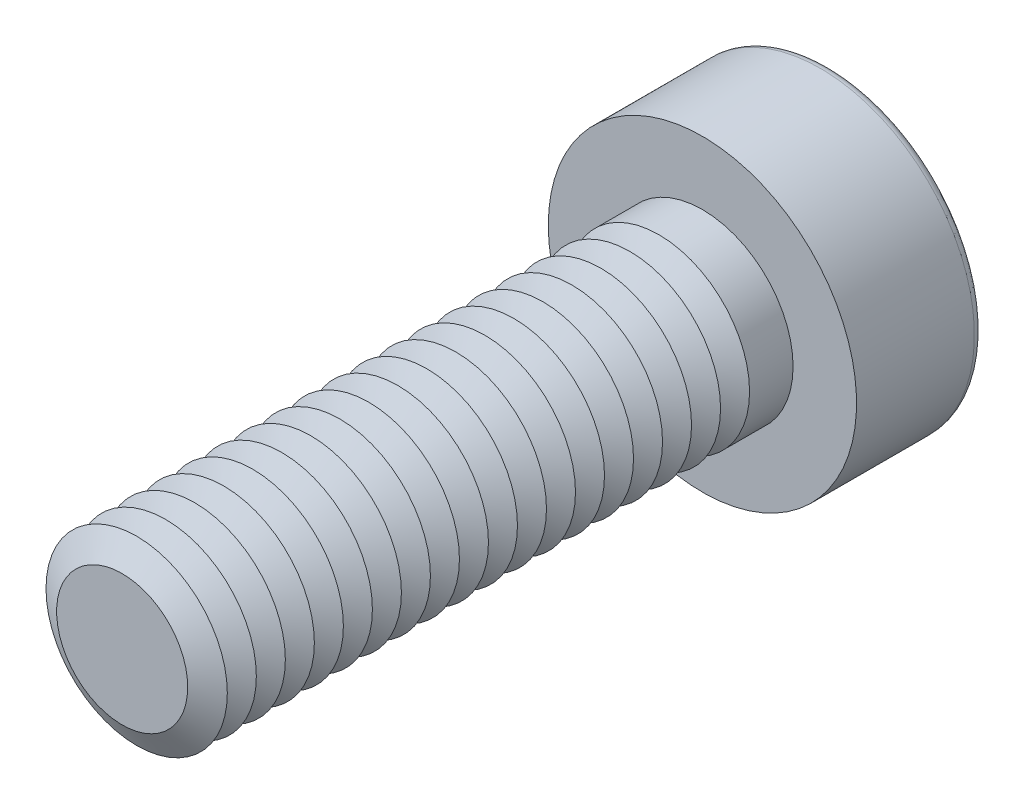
ISO-10303-21;
HEADER;
FILE_DESCRIPTION(('STEP AP214'),'2;1');
FILE_NAME('part.step','',(''),(''),'','','');
FILE_SCHEMA(('AUTOMOTIVE_DESIGN { 1 0 10303 214 1 1 1 1 }'));
ENDSEC;
DATA;
#1=APPLICATION_CONTEXT('core data for automotive mechanical design processes');
#2=APPLICATION_PROTOCOL_DEFINITION('international standard','automotive_design',2000,#1);
#3=PRODUCT_CONTEXT('',#1,'mechanical');
#4=PRODUCT('Part','Part','',(#3));
#5=PRODUCT_RELATED_PRODUCT_CATEGORY('part','',(#4));
#6=PRODUCT_DEFINITION_FORMATION('','',#4);
#7=PRODUCT_DEFINITION_CONTEXT('part definition',#1,'design');
#8=PRODUCT_DEFINITION('design','',#6,#7);
#9=PRODUCT_DEFINITION_SHAPE('','',#8);
#10=(LENGTH_UNIT() NAMED_UNIT(*) SI_UNIT(.MILLI.,.METRE.));
#11=(NAMED_UNIT(*) PLANE_ANGLE_UNIT() SI_UNIT($,.RADIAN.));
#12=(NAMED_UNIT(*) SI_UNIT($,.STERADIAN.) SOLID_ANGLE_UNIT());
#13=UNCERTAINTY_MEASURE_WITH_UNIT(LENGTH_MEASURE(1.E-05),#10,'distance_accuracy_value','');
#14=(GEOMETRIC_REPRESENTATION_CONTEXT(3) GLOBAL_UNCERTAINTY_ASSIGNED_CONTEXT((#13)) GLOBAL_UNIT_ASSIGNED_CONTEXT((#10,
#11,#12)) REPRESENTATION_CONTEXT('',''));
#15=CARTESIAN_POINT('',(0.,0.,0.));
#16=DIRECTION('',(0.,0.,1.));
#17=DIRECTION('',(1.,0.,0.));
#18=AXIS2_PLACEMENT_3D('',#15,#16,#17);
#19=CARTESIAN_POINT('',(0.,0.,13.2));
#20=DIRECTION('',(0.,0.,1.));
#21=DIRECTION('',(1.,0.,0.));
#22=AXIS2_PLACEMENT_3D('',#19,#20,#21);
#23=CONICAL_SURFACE('',#22,2.5,1.0471975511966);
#24=CARTESIAN_POINT('',(0.,0.,12.8));
#25=DIRECTION('',(0.,0.,1.));
#26=DIRECTION('',(1.,0.,0.));
#27=AXIS2_PLACEMENT_3D('',#24,#25,#26);
#28=CIRCLE('',#27,1.80717967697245);
#29=CARTESIAN_POINT('',(1.80717967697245,0.,12.8));
#30=VERTEX_POINT('',#29);
#31=EDGE_CURVE('E313',#30,#30,#28,.T.);
#32=ORIENTED_EDGE('',*,*,#31,.T.);
#33=EDGE_LOOP('',(#32));
#34=FACE_BOUND('',#33,.T.);
#35=CARTESIAN_POINT('',(0.,0.,13.2));
#36=DIRECTION('',(0.,0.,1.));
#37=DIRECTION('',(1.,0.,0.));
#38=AXIS2_PLACEMENT_3D('',#35,#36,#37);
#39=CIRCLE('',#38,2.5);
#40=CARTESIAN_POINT('',(2.5,0.,13.2));
#41=VERTEX_POINT('',#40);
#42=EDGE_CURVE('E316',#41,#41,#39,.T.);
#43=ORIENTED_EDGE('',*,*,#42,.F.);
#44=EDGE_LOOP('',(#43));
#45=FACE_BOUND('',#44,.T.);
#46=ADVANCED_FACE('F39',(#34,#45),#23,.T.);
#47=CARTESIAN_POINT('',(0.,0.,12.8));
#48=DIRECTION('',(0.,0.,-1.));
#49=DIRECTION('',(-1.,0.,0.));
#50=AXIS2_PLACEMENT_3D('',#47,#48,#49);
#51=CONICAL_SURFACE('',#50,1.80717967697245,1.0471975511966);
#52=CARTESIAN_POINT('',(0.,0.,12.4));
#53=DIRECTION('',(0.,0.,1.));
#54=DIRECTION('',(1.,0.,0.));
#55=AXIS2_PLACEMENT_3D('',#52,#53,#54);
#56=CIRCLE('',#55,2.5);
#57=CARTESIAN_POINT('',(2.5,0.,12.4));
#58=VERTEX_POINT('',#57);
#59=EDGE_CURVE('E324',#58,#58,#56,.T.);
#60=ORIENTED_EDGE('',*,*,#59,.T.);
#61=EDGE_LOOP('',(#60));
#62=FACE_BOUND('',#61,.T.);
#63=ORIENTED_EDGE('',*,*,#31,.F.);
#64=EDGE_LOOP('',(#63));
#65=FACE_BOUND('',#64,.T.);
#66=ADVANCED_FACE('F245',(#62,#65),#51,.T.);
#67=CARTESIAN_POINT('',(0.,0.,16.));
#68=DIRECTION('',(0.,0.,1.));
#69=DIRECTION('',(1.,0.,0.));
#70=AXIS2_PLACEMENT_3D('',#67,#68,#69);
#71=PLANE('',#70);
#72=CARTESIAN_POINT('',(0.,0.,16.));
#73=DIRECTION('',(0.,0.,1.));
#74=DIRECTION('',(1.,0.,0.));
#75=AXIS2_PLACEMENT_3D('',#72,#73,#74);
#76=CIRCLE('',#75,1.80717967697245);
#77=CARTESIAN_POINT('',(1.80717967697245,0.,16.));
#78=VERTEX_POINT('',#77);
#79=EDGE_CURVE('E174',#78,#78,#76,.T.);
#80=ORIENTED_EDGE('',*,*,#79,.T.);
#81=EDGE_LOOP('',(#80));
#82=FACE_BOUND('',#81,.T.);
#83=ADVANCED_FACE('F251',(#82),#71,.T.);
#84=CARTESIAN_POINT('',(0.,0.,16.));
#85=DIRECTION('',(0.,0.,-1.));
#86=DIRECTION('',(-1.,0.,0.));
#87=AXIS2_PLACEMENT_3D('',#84,#85,#86);
#88=CONICAL_SURFACE('',#87,1.80717967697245,1.0471975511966);
#89=CARTESIAN_POINT('',(0.,0.,15.6));
#90=DIRECTION('',(0.,0.,1.));
#91=DIRECTION('',(1.,0.,0.));
#92=AXIS2_PLACEMENT_3D('',#89,#90,#91);
#93=CIRCLE('',#92,2.5);
#94=CARTESIAN_POINT('',(2.5,0.,15.6));
#95=VERTEX_POINT('',#94);
#96=EDGE_CURVE('E291',#95,#95,#93,.T.);
#97=ORIENTED_EDGE('',*,*,#96,.T.);
#98=EDGE_LOOP('',(#97));
#99=FACE_BOUND('',#98,.T.);
#100=ORIENTED_EDGE('',*,*,#79,.F.);
#101=EDGE_LOOP('',(#100));
#102=FACE_BOUND('',#101,.T.);
#103=ADVANCED_FACE('F199',(#99,#102),#88,.T.);
#104=CARTESIAN_POINT('',(0.,0.,15.6));
#105=DIRECTION('',(0.,0.,1.));
#106=DIRECTION('',(1.,0.,0.));
#107=AXIS2_PLACEMENT_3D('',#104,#105,#106);
#108=CONICAL_SURFACE('',#107,2.5,1.0471975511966);
#109=CARTESIAN_POINT('',(0.,0.,15.2));
#110=DIRECTION('',(0.,0.,1.));
#111=DIRECTION('',(1.,0.,0.));
#112=AXIS2_PLACEMENT_3D('',#109,#110,#111);
#113=CIRCLE('',#112,1.80717967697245);
#114=CARTESIAN_POINT('',(1.80717967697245,0.,15.2));
#115=VERTEX_POINT('',#114);
#116=EDGE_CURVE('E288',#115,#115,#113,.T.);
#117=ORIENTED_EDGE('',*,*,#116,.T.);
#118=EDGE_LOOP('',(#117));
#119=FACE_BOUND('',#118,.T.);
#120=ORIENTED_EDGE('',*,*,#96,.F.);
#121=EDGE_LOOP('',(#120));
#122=FACE_BOUND('',#121,.T.);
#123=ADVANCED_FACE('F277',(#119,#122),#108,.T.);
#124=CARTESIAN_POINT('',(0.,0.,15.2));
#125=DIRECTION('',(0.,0.,-1.));
#126=DIRECTION('',(-1.,0.,0.));
#127=AXIS2_PLACEMENT_3D('',#124,#125,#126);
#128=CONICAL_SURFACE('',#127,1.80717967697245,1.0471975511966);
#129=CARTESIAN_POINT('',(0.,0.,14.8));
#130=DIRECTION('',(0.,0.,1.));
#131=DIRECTION('',(1.,0.,0.));
#132=AXIS2_PLACEMENT_3D('',#129,#130,#131);
#133=CIRCLE('',#132,2.5);
#134=CARTESIAN_POINT('',(2.5,0.,14.8));
#135=VERTEX_POINT('',#134);
#136=EDGE_CURVE('E299',#135,#135,#133,.T.);
#137=ORIENTED_EDGE('',*,*,#136,.T.);
#138=EDGE_LOOP('',(#137));
#139=FACE_BOUND('',#138,.T.);
#140=ORIENTED_EDGE('',*,*,#116,.F.);
#141=EDGE_LOOP('',(#140));
#142=FACE_BOUND('',#141,.T.);
#143=ADVANCED_FACE('F274',(#139,#142),#128,.T.);
#144=CARTESIAN_POINT('',(0.,0.,14.8));
#145=DIRECTION('',(0.,0.,1.));
#146=DIRECTION('',(1.,0.,0.));
#147=AXIS2_PLACEMENT_3D('',#144,#145,#146);
#148=CONICAL_SURFACE('',#147,2.5,1.0471975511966);
#149=CARTESIAN_POINT('',(0.,0.,14.4));
#150=DIRECTION('',(0.,0.,1.));
#151=DIRECTION('',(1.,0.,0.));
#152=AXIS2_PLACEMENT_3D('',#149,#150,#151);
#153=CIRCLE('',#152,1.80717967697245);
#154=CARTESIAN_POINT('',(1.80717967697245,0.,14.4));
#155=VERTEX_POINT('',#154);
#156=EDGE_CURVE('E293',#155,#155,#153,.T.);
#157=ORIENTED_EDGE('',*,*,#156,.T.);
#158=EDGE_LOOP('',(#157));
#159=FACE_BOUND('',#158,.T.);
#160=ORIENTED_EDGE('',*,*,#136,.F.);
#161=EDGE_LOOP('',(#160));
#162=FACE_BOUND('',#161,.T.);
#163=ADVANCED_FACE('F270',(#159,#162),#148,.T.);
#164=CARTESIAN_POINT('',(0.,0.,14.4));
#165=DIRECTION('',(0.,0.,-1.));
#166=DIRECTION('',(-1.,0.,0.));
#167=AXIS2_PLACEMENT_3D('',#164,#165,#166);
#168=CONICAL_SURFACE('',#167,1.80717967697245,1.0471975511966);
#169=CARTESIAN_POINT('',(0.,0.,14.));
#170=DIRECTION('',(0.,0.,1.));
#171=DIRECTION('',(1.,0.,0.));
#172=AXIS2_PLACEMENT_3D('',#169,#170,#171);
#173=CIRCLE('',#172,2.5);
#174=CARTESIAN_POINT('',(2.5,0.,14.));
#175=VERTEX_POINT('',#174);
#176=EDGE_CURVE('E309',#175,#175,#173,.T.);
#177=ORIENTED_EDGE('',*,*,#176,.T.);
#178=EDGE_LOOP('',(#177));
#179=FACE_BOUND('',#178,.T.);
#180=ORIENTED_EDGE('',*,*,#156,.F.);
#181=EDGE_LOOP('',(#180));
#182=FACE_BOUND('',#181,.T.);
#183=ADVANCED_FACE('F266',(#179,#182),#168,.T.);
#184=CARTESIAN_POINT('',(0.,0.,14.));
#185=DIRECTION('',(0.,0.,1.));
#186=DIRECTION('',(1.,0.,0.));
#187=AXIS2_PLACEMENT_3D('',#184,#185,#186);
#188=CONICAL_SURFACE('',#187,2.5,1.0471975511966);
#189=CARTESIAN_POINT('',(0.,0.,13.6));
#190=DIRECTION('',(0.,0.,1.));
#191=DIRECTION('',(1.,0.,0.));
#192=AXIS2_PLACEMENT_3D('',#189,#190,#191);
#193=CIRCLE('',#192,1.80717967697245);
#194=CARTESIAN_POINT('',(1.80717967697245,0.,13.6));
#195=VERTEX_POINT('',#194);
#196=EDGE_CURVE('E305',#195,#195,#193,.T.);
#197=ORIENTED_EDGE('',*,*,#196,.T.);
#198=EDGE_LOOP('',(#197));
#199=FACE_BOUND('',#198,.T.);
#200=ORIENTED_EDGE('',*,*,#176,.F.);
#201=EDGE_LOOP('',(#200));
#202=FACE_BOUND('',#201,.T.);
#203=ADVANCED_FACE('F262',(#199,#202),#188,.T.);
#204=CARTESIAN_POINT('',(0.,0.,13.6));
#205=DIRECTION('',(0.,0.,-1.));
#206=DIRECTION('',(-1.,0.,0.));
#207=AXIS2_PLACEMENT_3D('',#204,#205,#206);
#208=CONICAL_SURFACE('',#207,1.80717967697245,1.0471975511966);
#209=ORIENTED_EDGE('',*,*,#42,.T.);
#210=EDGE_LOOP('',(#209));
#211=FACE_BOUND('',#210,.T.);
#212=ORIENTED_EDGE('',*,*,#196,.F.);
#213=EDGE_LOOP('',(#212));
#214=FACE_BOUND('',#213,.T.);
#215=ADVANCED_FACE('F258',(#211,#214),#208,.T.);
#216=CARTESIAN_POINT('',(0.,0.,12.4));
#217=DIRECTION('',(0.,0.,1.));
#218=DIRECTION('',(1.,0.,0.));
#219=AXIS2_PLACEMENT_3D('',#216,#217,#218);
#220=CONICAL_SURFACE('',#219,2.5,1.0471975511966);
#221=CARTESIAN_POINT('',(0.,0.,12.));
#222=DIRECTION('',(0.,0.,1.));
#223=DIRECTION('',(1.,0.,0.));
#224=AXIS2_PLACEMENT_3D('',#221,#222,#223);
#225=CIRCLE('',#224,1.80717967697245);
#226=CARTESIAN_POINT('',(1.80717967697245,0.,12.));
#227=VERTEX_POINT('',#226);
#228=EDGE_CURVE('E320',#227,#227,#225,.T.);
#229=ORIENTED_EDGE('',*,*,#228,.T.);
#230=EDGE_LOOP('',(#229));
#231=FACE_BOUND('',#230,.T.);
#232=ORIENTED_EDGE('',*,*,#59,.F.);
#233=EDGE_LOOP('',(#232));
#234=FACE_BOUND('',#233,.T.);
#235=ADVANCED_FACE('F261',(#231,#234),#220,.T.);
#236=CARTESIAN_POINT('',(0.,0.,12.));
#237=DIRECTION('',(0.,0.,-1.));
#238=DIRECTION('',(-1.,0.,0.));
#239=AXIS2_PLACEMENT_3D('',#236,#237,#238);
#240=CONICAL_SURFACE('',#239,1.80717967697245,1.0471975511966);
#241=CARTESIAN_POINT('',(0.,0.,11.6));
#242=DIRECTION('',(0.,0.,1.));
#243=DIRECTION('',(1.,0.,0.));
#244=AXIS2_PLACEMENT_3D('',#241,#242,#243);
#245=CIRCLE('',#244,2.5);
#246=CARTESIAN_POINT('',(2.5,0.,11.6));
#247=VERTEX_POINT('',#246);
#248=EDGE_CURVE('E331',#247,#247,#245,.T.);
#249=ORIENTED_EDGE('',*,*,#248,.T.);
#250=EDGE_LOOP('',(#249));
#251=FACE_BOUND('',#250,.T.);
#252=ORIENTED_EDGE('',*,*,#228,.F.);
#253=EDGE_LOOP('',(#252));
#254=FACE_BOUND('',#253,.T.);
#255=ADVANCED_FACE('F543',(#251,#254),#240,.T.);
#256=CARTESIAN_POINT('',(0.,0.,11.6));
#257=DIRECTION('',(0.,0.,1.));
#258=DIRECTION('',(1.,0.,0.));
#259=AXIS2_PLACEMENT_3D('',#256,#257,#258);
#260=CONICAL_SURFACE('',#259,2.5,1.0471975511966);
#261=CARTESIAN_POINT('',(0.,0.,11.2));
#262=DIRECTION('',(0.,0.,1.));
#263=DIRECTION('',(1.,0.,0.));
#264=AXIS2_PLACEMENT_3D('',#261,#262,#263);
#265=CIRCLE('',#264,1.80717967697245);
#266=CARTESIAN_POINT('',(1.80717967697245,0.,11.2));
#267=VERTEX_POINT('',#266);
#268=EDGE_CURVE('E328',#267,#267,#265,.T.);
#269=ORIENTED_EDGE('',*,*,#268,.T.);
#270=EDGE_LOOP('',(#269));
#271=FACE_BOUND('',#270,.T.);
#272=ORIENTED_EDGE('',*,*,#248,.F.);
#273=EDGE_LOOP('',(#272));
#274=FACE_BOUND('',#273,.T.);
#275=ADVANCED_FACE('F539',(#271,#274),#260,.T.);
#276=CARTESIAN_POINT('',(0.,0.,11.2));
#277=DIRECTION('',(0.,0.,-1.));
#278=DIRECTION('',(-1.,0.,0.));
#279=AXIS2_PLACEMENT_3D('',#276,#277,#278);
#280=CONICAL_SURFACE('',#279,1.80717967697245,1.0471975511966);
#281=CARTESIAN_POINT('',(0.,0.,10.8));
#282=DIRECTION('',(0.,0.,1.));
#283=DIRECTION('',(1.,0.,0.));
#284=AXIS2_PLACEMENT_3D('',#281,#282,#283);
#285=CIRCLE('',#284,2.5);
#286=CARTESIAN_POINT('',(2.5,0.,10.8));
#287=VERTEX_POINT('',#286);
#288=EDGE_CURVE('E339',#287,#287,#285,.T.);
#289=ORIENTED_EDGE('',*,*,#288,.T.);
#290=EDGE_LOOP('',(#289));
#291=FACE_BOUND('',#290,.T.);
#292=ORIENTED_EDGE('',*,*,#268,.F.);
#293=EDGE_LOOP('',(#292));
#294=FACE_BOUND('',#293,.T.);
#295=ADVANCED_FACE('F535',(#291,#294),#280,.T.);
#296=CARTESIAN_POINT('',(0.,0.,10.8));
#297=DIRECTION('',(0.,0.,1.));
#298=DIRECTION('',(1.,0.,0.));
#299=AXIS2_PLACEMENT_3D('',#296,#297,#298);
#300=CONICAL_SURFACE('',#299,2.5,1.0471975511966);
#301=CARTESIAN_POINT('',(0.,0.,10.4));
#302=DIRECTION('',(0.,0.,1.));
#303=DIRECTION('',(1.,0.,0.));
#304=AXIS2_PLACEMENT_3D('',#301,#302,#303);
#305=CIRCLE('',#304,1.80717967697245);
#306=CARTESIAN_POINT('',(1.80717967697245,0.,10.4));
#307=VERTEX_POINT('',#306);
#308=EDGE_CURVE('E335',#307,#307,#305,.T.);
#309=ORIENTED_EDGE('',*,*,#308,.T.);
#310=EDGE_LOOP('',(#309));
#311=FACE_BOUND('',#310,.T.);
#312=ORIENTED_EDGE('',*,*,#288,.F.);
#313=EDGE_LOOP('',(#312));
#314=FACE_BOUND('',#313,.T.);
#315=ADVANCED_FACE('F531',(#311,#314),#300,.T.);
#316=CARTESIAN_POINT('',(0.,0.,10.4));
#317=DIRECTION('',(0.,0.,-1.));
#318=DIRECTION('',(-1.,0.,0.));
#319=AXIS2_PLACEMENT_3D('',#316,#317,#318);
#320=CONICAL_SURFACE('',#319,1.80717967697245,1.0471975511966);
#321=CARTESIAN_POINT('',(0.,0.,10.));
#322=DIRECTION('',(0.,0.,1.));
#323=DIRECTION('',(1.,0.,0.));
#324=AXIS2_PLACEMENT_3D('',#321,#322,#323);
#325=CIRCLE('',#324,2.5);
#326=CARTESIAN_POINT('',(2.5,0.,10.));
#327=VERTEX_POINT('',#326);
#328=EDGE_CURVE('E347',#327,#327,#325,.T.);
#329=ORIENTED_EDGE('',*,*,#328,.T.);
#330=EDGE_LOOP('',(#329));
#331=FACE_BOUND('',#330,.T.);
#332=ORIENTED_EDGE('',*,*,#308,.F.);
#333=EDGE_LOOP('',(#332));
#334=FACE_BOUND('',#333,.T.);
#335=ADVANCED_FACE('F527',(#331,#334),#320,.T.);
#336=CARTESIAN_POINT('',(0.,0.,10.));
#337=DIRECTION('',(0.,0.,1.));
#338=DIRECTION('',(1.,0.,0.));
#339=AXIS2_PLACEMENT_3D('',#336,#337,#338);
#340=CONICAL_SURFACE('',#339,2.5,1.0471975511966);
#341=CARTESIAN_POINT('',(0.,0.,9.6));
#342=DIRECTION('',(0.,0.,1.));
#343=DIRECTION('',(1.,0.,0.));
#344=AXIS2_PLACEMENT_3D('',#341,#342,#343);
#345=CIRCLE('',#344,1.80717967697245);
#346=CARTESIAN_POINT('',(1.80717967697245,0.,9.6));
#347=VERTEX_POINT('',#346);
#348=EDGE_CURVE('E343',#347,#347,#345,.T.);
#349=ORIENTED_EDGE('',*,*,#348,.T.);
#350=EDGE_LOOP('',(#349));
#351=FACE_BOUND('',#350,.T.);
#352=ORIENTED_EDGE('',*,*,#328,.F.);
#353=EDGE_LOOP('',(#352));
#354=FACE_BOUND('',#353,.T.);
#355=ADVANCED_FACE('F523',(#351,#354),#340,.T.);
#356=CARTESIAN_POINT('',(0.,0.,9.6));
#357=DIRECTION('',(0.,0.,-1.));
#358=DIRECTION('',(-1.,0.,0.));
#359=AXIS2_PLACEMENT_3D('',#356,#357,#358);
#360=CONICAL_SURFACE('',#359,1.80717967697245,1.0471975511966);
#361=CARTESIAN_POINT('',(0.,0.,9.2));
#362=DIRECTION('',(0.,0.,1.));
#363=DIRECTION('',(1.,0.,0.));
#364=AXIS2_PLACEMENT_3D('',#361,#362,#363);
#365=CIRCLE('',#364,2.5);
#366=CARTESIAN_POINT('',(2.5,0.,9.2));
#367=VERTEX_POINT('',#366);
#368=EDGE_CURVE('E355',#367,#367,#365,.T.);
#369=ORIENTED_EDGE('',*,*,#368,.T.);
#370=EDGE_LOOP('',(#369));
#371=FACE_BOUND('',#370,.T.);
#372=ORIENTED_EDGE('',*,*,#348,.F.);
#373=EDGE_LOOP('',(#372));
#374=FACE_BOUND('',#373,.T.);
#375=ADVANCED_FACE('F519',(#371,#374),#360,.T.);
#376=CARTESIAN_POINT('',(0.,0.,9.2));
#377=DIRECTION('',(0.,0.,1.));
#378=DIRECTION('',(1.,0.,0.));
#379=AXIS2_PLACEMENT_3D('',#376,#377,#378);
#380=CONICAL_SURFACE('',#379,2.5,1.0471975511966);
#381=CARTESIAN_POINT('',(0.,0.,8.8));
#382=DIRECTION('',(0.,0.,1.));
#383=DIRECTION('',(1.,0.,0.));
#384=AXIS2_PLACEMENT_3D('',#381,#382,#383);
#385=CIRCLE('',#384,1.80717967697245);
#386=CARTESIAN_POINT('',(1.80717967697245,0.,8.8));
#387=VERTEX_POINT('',#386);
#388=EDGE_CURVE('E351',#387,#387,#385,.T.);
#389=ORIENTED_EDGE('',*,*,#388,.T.);
#390=EDGE_LOOP('',(#389));
#391=FACE_BOUND('',#390,.T.);
#392=ORIENTED_EDGE('',*,*,#368,.F.);
#393=EDGE_LOOP('',(#392));
#394=FACE_BOUND('',#393,.T.);
#395=ADVANCED_FACE('F515',(#391,#394),#380,.T.);
#396=CARTESIAN_POINT('',(0.,0.,8.8));
#397=DIRECTION('',(0.,0.,-1.));
#398=DIRECTION('',(-1.,0.,0.));
#399=AXIS2_PLACEMENT_3D('',#396,#397,#398);
#400=CONICAL_SURFACE('',#399,1.80717967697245,1.0471975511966);
#401=CARTESIAN_POINT('',(0.,0.,8.4));
#402=DIRECTION('',(0.,0.,1.));
#403=DIRECTION('',(1.,0.,0.));
#404=AXIS2_PLACEMENT_3D('',#401,#402,#403);
#405=CIRCLE('',#404,2.5);
#406=CARTESIAN_POINT('',(2.5,0.,8.4));
#407=VERTEX_POINT('',#406);
#408=EDGE_CURVE('E363',#407,#407,#405,.T.);
#409=ORIENTED_EDGE('',*,*,#408,.T.);
#410=EDGE_LOOP('',(#409));
#411=FACE_BOUND('',#410,.T.);
#412=ORIENTED_EDGE('',*,*,#388,.F.);
#413=EDGE_LOOP('',(#412));
#414=FACE_BOUND('',#413,.T.);
#415=ADVANCED_FACE('F511',(#411,#414),#400,.T.);
#416=CARTESIAN_POINT('',(0.,0.,8.4));
#417=DIRECTION('',(0.,0.,1.));
#418=DIRECTION('',(1.,0.,0.));
#419=AXIS2_PLACEMENT_3D('',#416,#417,#418);
#420=CONICAL_SURFACE('',#419,2.5,1.0471975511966);
#421=CARTESIAN_POINT('',(0.,0.,8.));
#422=DIRECTION('',(0.,0.,1.));
#423=DIRECTION('',(1.,0.,0.));
#424=AXIS2_PLACEMENT_3D('',#421,#422,#423);
#425=CIRCLE('',#424,1.80717967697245);
#426=CARTESIAN_POINT('',(1.80717967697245,0.,8.));
#427=VERTEX_POINT('',#426);
#428=EDGE_CURVE('E359',#427,#427,#425,.T.);
#429=ORIENTED_EDGE('',*,*,#428,.T.);
#430=EDGE_LOOP('',(#429));
#431=FACE_BOUND('',#430,.T.);
#432=ORIENTED_EDGE('',*,*,#408,.F.);
#433=EDGE_LOOP('',(#432));
#434=FACE_BOUND('',#433,.T.);
#435=ADVANCED_FACE('F507',(#431,#434),#420,.T.);
#436=CARTESIAN_POINT('',(0.,0.,8.));
#437=DIRECTION('',(0.,0.,-1.));
#438=DIRECTION('',(-1.,0.,0.));
#439=AXIS2_PLACEMENT_3D('',#436,#437,#438);
#440=CONICAL_SURFACE('',#439,1.80717967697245,1.0471975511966);
#441=CARTESIAN_POINT('',(0.,0.,7.6));
#442=DIRECTION('',(0.,0.,1.));
#443=DIRECTION('',(1.,0.,0.));
#444=AXIS2_PLACEMENT_3D('',#441,#442,#443);
#445=CIRCLE('',#444,2.5);
#446=CARTESIAN_POINT('',(2.5,0.,7.6));
#447=VERTEX_POINT('',#446);
#448=EDGE_CURVE('E371',#447,#447,#445,.T.);
#449=ORIENTED_EDGE('',*,*,#448,.T.);
#450=EDGE_LOOP('',(#449));
#451=FACE_BOUND('',#450,.T.);
#452=ORIENTED_EDGE('',*,*,#428,.F.);
#453=EDGE_LOOP('',(#452));
#454=FACE_BOUND('',#453,.T.);
#455=ADVANCED_FACE('F503',(#451,#454),#440,.T.);
#456=CARTESIAN_POINT('',(0.,0.,7.6));
#457=DIRECTION('',(0.,0.,1.));
#458=DIRECTION('',(1.,0.,0.));
#459=AXIS2_PLACEMENT_3D('',#456,#457,#458);
#460=CONICAL_SURFACE('',#459,2.5,1.0471975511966);
#461=CARTESIAN_POINT('',(0.,0.,7.2));
#462=DIRECTION('',(0.,0.,1.));
#463=DIRECTION('',(1.,0.,0.));
#464=AXIS2_PLACEMENT_3D('',#461,#462,#463);
#465=CIRCLE('',#464,1.80717967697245);
#466=CARTESIAN_POINT('',(1.80717967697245,0.,7.2));
#467=VERTEX_POINT('',#466);
#468=EDGE_CURVE('E367',#467,#467,#465,.T.);
#469=ORIENTED_EDGE('',*,*,#468,.T.);
#470=EDGE_LOOP('',(#469));
#471=FACE_BOUND('',#470,.T.);
#472=ORIENTED_EDGE('',*,*,#448,.F.);
#473=EDGE_LOOP('',(#472));
#474=FACE_BOUND('',#473,.T.);
#475=ADVANCED_FACE('F499',(#471,#474),#460,.T.);
#476=CARTESIAN_POINT('',(0.,0.,7.2));
#477=DIRECTION('',(0.,0.,-1.));
#478=DIRECTION('',(-1.,0.,0.));
#479=AXIS2_PLACEMENT_3D('',#476,#477,#478);
#480=CONICAL_SURFACE('',#479,1.80717967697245,1.0471975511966);
#481=CARTESIAN_POINT('',(0.,0.,6.8));
#482=DIRECTION('',(0.,0.,1.));
#483=DIRECTION('',(1.,0.,0.));
#484=AXIS2_PLACEMENT_3D('',#481,#482,#483);
#485=CIRCLE('',#484,2.5);
#486=CARTESIAN_POINT('',(2.5,0.,6.8));
#487=VERTEX_POINT('',#486);
#488=EDGE_CURVE('E379',#487,#487,#485,.T.);
#489=ORIENTED_EDGE('',*,*,#488,.T.);
#490=EDGE_LOOP('',(#489));
#491=FACE_BOUND('',#490,.T.);
#492=ORIENTED_EDGE('',*,*,#468,.F.);
#493=EDGE_LOOP('',(#492));
#494=FACE_BOUND('',#493,.T.);
#495=ADVANCED_FACE('F495',(#491,#494),#480,.T.);
#496=CARTESIAN_POINT('',(0.,0.,6.8));
#497=DIRECTION('',(0.,0.,1.));
#498=DIRECTION('',(1.,0.,0.));
#499=AXIS2_PLACEMENT_3D('',#496,#497,#498);
#500=CONICAL_SURFACE('',#499,2.5,1.0471975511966);
#501=CARTESIAN_POINT('',(0.,0.,6.4));
#502=DIRECTION('',(0.,0.,1.));
#503=DIRECTION('',(1.,0.,0.));
#504=AXIS2_PLACEMENT_3D('',#501,#502,#503);
#505=CIRCLE('',#504,1.80717967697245);
#506=CARTESIAN_POINT('',(1.80717967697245,0.,6.4));
#507=VERTEX_POINT('',#506);
#508=EDGE_CURVE('E375',#507,#507,#505,.T.);
#509=ORIENTED_EDGE('',*,*,#508,.T.);
#510=EDGE_LOOP('',(#509));
#511=FACE_BOUND('',#510,.T.);
#512=ORIENTED_EDGE('',*,*,#488,.F.);
#513=EDGE_LOOP('',(#512));
#514=FACE_BOUND('',#513,.T.);
#515=ADVANCED_FACE('F491',(#511,#514),#500,.T.);
#516=CARTESIAN_POINT('',(0.,0.,6.4));
#517=DIRECTION('',(0.,0.,-1.));
#518=DIRECTION('',(-1.,0.,0.));
#519=AXIS2_PLACEMENT_3D('',#516,#517,#518);
#520=CONICAL_SURFACE('',#519,1.80717967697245,1.0471975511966);
#521=CARTESIAN_POINT('',(0.,0.,6.));
#522=DIRECTION('',(0.,0.,1.));
#523=DIRECTION('',(1.,0.,0.));
#524=AXIS2_PLACEMENT_3D('',#521,#522,#523);
#525=CIRCLE('',#524,2.5);
#526=CARTESIAN_POINT('',(2.5,0.,6.));
#527=VERTEX_POINT('',#526);
#528=EDGE_CURVE('E387',#527,#527,#525,.T.);
#529=ORIENTED_EDGE('',*,*,#528,.T.);
#530=EDGE_LOOP('',(#529));
#531=FACE_BOUND('',#530,.T.);
#532=ORIENTED_EDGE('',*,*,#508,.F.);
#533=EDGE_LOOP('',(#532));
#534=FACE_BOUND('',#533,.T.);
#535=ADVANCED_FACE('F487',(#531,#534),#520,.T.);
#536=CARTESIAN_POINT('',(0.,0.,6.));
#537=DIRECTION('',(0.,0.,1.));
#538=DIRECTION('',(1.,0.,0.));
#539=AXIS2_PLACEMENT_3D('',#536,#537,#538);
#540=CONICAL_SURFACE('',#539,2.5,1.0471975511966);
#541=CARTESIAN_POINT('',(0.,0.,5.6));
#542=DIRECTION('',(0.,0.,1.));
#543=DIRECTION('',(1.,0.,0.));
#544=AXIS2_PLACEMENT_3D('',#541,#542,#543);
#545=CIRCLE('',#544,1.80717967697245);
#546=CARTESIAN_POINT('',(1.80717967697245,0.,5.6));
#547=VERTEX_POINT('',#546);
#548=EDGE_CURVE('E383',#547,#547,#545,.T.);
#549=ORIENTED_EDGE('',*,*,#548,.T.);
#550=EDGE_LOOP('',(#549));
#551=FACE_BOUND('',#550,.T.);
#552=ORIENTED_EDGE('',*,*,#528,.F.);
#553=EDGE_LOOP('',(#552));
#554=FACE_BOUND('',#553,.T.);
#555=ADVANCED_FACE('F483',(#551,#554),#540,.T.);
#556=CARTESIAN_POINT('',(0.,0.,5.6));
#557=DIRECTION('',(0.,0.,-1.));
#558=DIRECTION('',(-1.,0.,0.));
#559=AXIS2_PLACEMENT_3D('',#556,#557,#558);
#560=CONICAL_SURFACE('',#559,1.80717967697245,1.0471975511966);
#561=CARTESIAN_POINT('',(0.,0.,5.2));
#562=DIRECTION('',(0.,0.,1.));
#563=DIRECTION('',(1.,0.,0.));
#564=AXIS2_PLACEMENT_3D('',#561,#562,#563);
#565=CIRCLE('',#564,2.5);
#566=CARTESIAN_POINT('',(2.5,0.,5.2));
#567=VERTEX_POINT('',#566);
#568=EDGE_CURVE('E395',#567,#567,#565,.T.);
#569=ORIENTED_EDGE('',*,*,#568,.T.);
#570=EDGE_LOOP('',(#569));
#571=FACE_BOUND('',#570,.T.);
#572=ORIENTED_EDGE('',*,*,#548,.F.);
#573=EDGE_LOOP('',(#572));
#574=FACE_BOUND('',#573,.T.);
#575=ADVANCED_FACE('F479',(#571,#574),#560,.T.);
#576=CARTESIAN_POINT('',(0.,0.,5.2));
#577=DIRECTION('',(0.,0.,1.));
#578=DIRECTION('',(1.,0.,0.));
#579=AXIS2_PLACEMENT_3D('',#576,#577,#578);
#580=CONICAL_SURFACE('',#579,2.5,1.0471975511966);
#581=CARTESIAN_POINT('',(0.,0.,4.8));
#582=DIRECTION('',(0.,0.,1.));
#583=DIRECTION('',(1.,0.,0.));
#584=AXIS2_PLACEMENT_3D('',#581,#582,#583);
#585=CIRCLE('',#584,1.80717967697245);
#586=CARTESIAN_POINT('',(1.80717967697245,0.,4.8));
#587=VERTEX_POINT('',#586);
#588=EDGE_CURVE('E391',#587,#587,#585,.T.);
#589=ORIENTED_EDGE('',*,*,#588,.T.);
#590=EDGE_LOOP('',(#589));
#591=FACE_BOUND('',#590,.T.);
#592=ORIENTED_EDGE('',*,*,#568,.F.);
#593=EDGE_LOOP('',(#592));
#594=FACE_BOUND('',#593,.T.);
#595=ADVANCED_FACE('F475',(#591,#594),#580,.T.);
#596=CARTESIAN_POINT('',(0.,0.,4.8));
#597=DIRECTION('',(0.,0.,-1.));
#598=DIRECTION('',(-1.,0.,0.));
#599=AXIS2_PLACEMENT_3D('',#596,#597,#598);
#600=CONICAL_SURFACE('',#599,1.80717967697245,1.0471975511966);
#601=CARTESIAN_POINT('',(0.,0.,4.4));
#602=DIRECTION('',(0.,0.,1.));
#603=DIRECTION('',(1.,0.,0.));
#604=AXIS2_PLACEMENT_3D('',#601,#602,#603);
#605=CIRCLE('',#604,2.5);
#606=CARTESIAN_POINT('',(2.5,0.,4.4));
#607=VERTEX_POINT('',#606);
#608=EDGE_CURVE('E403',#607,#607,#605,.T.);
#609=ORIENTED_EDGE('',*,*,#608,.T.);
#610=EDGE_LOOP('',(#609));
#611=FACE_BOUND('',#610,.T.);
#612=ORIENTED_EDGE('',*,*,#588,.F.);
#613=EDGE_LOOP('',(#612));
#614=FACE_BOUND('',#613,.T.);
#615=ADVANCED_FACE('F471',(#611,#614),#600,.T.);
#616=CARTESIAN_POINT('',(0.,0.,4.4));
#617=DIRECTION('',(0.,0.,1.));
#618=DIRECTION('',(1.,0.,0.));
#619=AXIS2_PLACEMENT_3D('',#616,#617,#618);
#620=CONICAL_SURFACE('',#619,2.5,1.0471975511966);
#621=CARTESIAN_POINT('',(0.,0.,4.));
#622=DIRECTION('',(0.,0.,1.));
#623=DIRECTION('',(1.,0.,0.));
#624=AXIS2_PLACEMENT_3D('',#621,#622,#623);
#625=CIRCLE('',#624,1.80717967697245);
#626=CARTESIAN_POINT('',(1.80717967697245,0.,4.));
#627=VERTEX_POINT('',#626);
#628=EDGE_CURVE('E399',#627,#627,#625,.T.);
#629=ORIENTED_EDGE('',*,*,#628,.T.);
#630=EDGE_LOOP('',(#629));
#631=FACE_BOUND('',#630,.T.);
#632=ORIENTED_EDGE('',*,*,#608,.F.);
#633=EDGE_LOOP('',(#632));
#634=FACE_BOUND('',#633,.T.);
#635=ADVANCED_FACE('F467',(#631,#634),#620,.T.);
#636=CARTESIAN_POINT('',(0.,0.,4.));
#637=DIRECTION('',(0.,0.,-1.));
#638=DIRECTION('',(-1.,0.,0.));
#639=AXIS2_PLACEMENT_3D('',#636,#637,#638);
#640=CONICAL_SURFACE('',#639,1.80717967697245,1.0471975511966);
#641=CARTESIAN_POINT('',(0.,0.,3.6));
#642=DIRECTION('',(0.,0.,1.));
#643=DIRECTION('',(1.,0.,0.));
#644=AXIS2_PLACEMENT_3D('',#641,#642,#643);
#645=CIRCLE('',#644,2.5);
#646=CARTESIAN_POINT('',(2.5,0.,3.6));
#647=VERTEX_POINT('',#646);
#648=EDGE_CURVE('E411',#647,#647,#645,.T.);
#649=ORIENTED_EDGE('',*,*,#648,.T.);
#650=EDGE_LOOP('',(#649));
#651=FACE_BOUND('',#650,.T.);
#652=ORIENTED_EDGE('',*,*,#628,.F.);
#653=EDGE_LOOP('',(#652));
#654=FACE_BOUND('',#653,.T.);
#655=ADVANCED_FACE('F463',(#651,#654),#640,.T.);
#656=CARTESIAN_POINT('',(0.,0.,3.6));
#657=DIRECTION('',(0.,0.,1.));
#658=DIRECTION('',(1.,0.,0.));
#659=AXIS2_PLACEMENT_3D('',#656,#657,#658);
#660=CONICAL_SURFACE('',#659,2.5,1.0471975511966);
#661=CARTESIAN_POINT('',(0.,0.,3.2));
#662=DIRECTION('',(0.,0.,1.));
#663=DIRECTION('',(1.,0.,0.));
#664=AXIS2_PLACEMENT_3D('',#661,#662,#663);
#665=CIRCLE('',#664,1.80717967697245);
#666=CARTESIAN_POINT('',(1.80717967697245,0.,3.2));
#667=VERTEX_POINT('',#666);
#668=EDGE_CURVE('E407',#667,#667,#665,.T.);
#669=ORIENTED_EDGE('',*,*,#668,.T.);
#670=EDGE_LOOP('',(#669));
#671=FACE_BOUND('',#670,.T.);
#672=ORIENTED_EDGE('',*,*,#648,.F.);
#673=EDGE_LOOP('',(#672));
#674=FACE_BOUND('',#673,.T.);
#675=ADVANCED_FACE('F459',(#671,#674),#660,.T.);
#676=CARTESIAN_POINT('',(0.,0.,3.2));
#677=DIRECTION('',(0.,0.,-1.));
#678=DIRECTION('',(-1.,0.,0.));
#679=AXIS2_PLACEMENT_3D('',#676,#677,#678);
#680=CONICAL_SURFACE('',#679,1.80717967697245,1.0471975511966);
#681=CARTESIAN_POINT('',(0.,0.,2.8));
#682=DIRECTION('',(0.,0.,1.));
#683=DIRECTION('',(1.,0.,0.));
#684=AXIS2_PLACEMENT_3D('',#681,#682,#683);
#685=CIRCLE('',#684,2.5);
#686=CARTESIAN_POINT('',(2.5,0.,2.8));
#687=VERTEX_POINT('',#686);
#688=EDGE_CURVE('E419',#687,#687,#685,.T.);
#689=ORIENTED_EDGE('',*,*,#688,.T.);
#690=EDGE_LOOP('',(#689));
#691=FACE_BOUND('',#690,.T.);
#692=ORIENTED_EDGE('',*,*,#668,.F.);
#693=EDGE_LOOP('',(#692));
#694=FACE_BOUND('',#693,.T.);
#695=ADVANCED_FACE('F455',(#691,#694),#680,.T.);
#696=CARTESIAN_POINT('',(0.,0.,2.8));
#697=DIRECTION('',(0.,0.,1.));
#698=DIRECTION('',(1.,0.,0.));
#699=AXIS2_PLACEMENT_3D('',#696,#697,#698);
#700=CONICAL_SURFACE('',#699,2.5,1.0471975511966);
#701=CARTESIAN_POINT('',(0.,0.,2.4));
#702=DIRECTION('',(0.,0.,1.));
#703=DIRECTION('',(1.,0.,0.));
#704=AXIS2_PLACEMENT_3D('',#701,#702,#703);
#705=CIRCLE('',#704,1.80717967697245);
#706=CARTESIAN_POINT('',(1.80717967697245,0.,2.4));
#707=VERTEX_POINT('',#706);
#708=EDGE_CURVE('E415',#707,#707,#705,.T.);
#709=ORIENTED_EDGE('',*,*,#708,.T.);
#710=EDGE_LOOP('',(#709));
#711=FACE_BOUND('',#710,.T.);
#712=ORIENTED_EDGE('',*,*,#688,.F.);
#713=EDGE_LOOP('',(#712));
#714=FACE_BOUND('',#713,.T.);
#715=ADVANCED_FACE('F450',(#711,#714),#700,.T.);
#716=CARTESIAN_POINT('',(0.,0.,2.4));
#717=DIRECTION('',(0.,0.,-1.));
#718=DIRECTION('',(-1.,0.,0.));
#719=AXIS2_PLACEMENT_3D('',#716,#717,#718);
#720=CONICAL_SURFACE('',#719,1.80717967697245,1.0471975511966);
#721=CARTESIAN_POINT('',(0.,0.,2.));
#722=DIRECTION('',(0.,0.,1.));
#723=DIRECTION('',(1.,0.,0.));
#724=AXIS2_PLACEMENT_3D('',#721,#722,#723);
#725=CIRCLE('',#724,2.5);
#726=CARTESIAN_POINT('',(2.5,0.,2.));
#727=VERTEX_POINT('',#726);
#728=EDGE_CURVE('E431',#727,#727,#725,.T.);
#729=ORIENTED_EDGE('',*,*,#728,.T.);
#730=EDGE_LOOP('',(#729));
#731=FACE_BOUND('',#730,.T.);
#732=ORIENTED_EDGE('',*,*,#708,.F.);
#733=EDGE_LOOP('',(#732));
#734=FACE_BOUND('',#733,.T.);
#735=ADVANCED_FACE('F436',(#731,#734),#720,.T.);
#736=CARTESIAN_POINT('',(0.,0.,2.));
#737=DIRECTION('',(0.,0.,1.));
#738=DIRECTION('',(1.,0.,0.));
#739=AXIS2_PLACEMENT_3D('',#736,#737,#738);
#740=CONICAL_SURFACE('',#739,2.5,1.0471975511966);
#741=CARTESIAN_POINT('',(0.,0.,1.6));
#742=DIRECTION('',(0.,0.,1.));
#743=DIRECTION('',(1.,0.,0.));
#744=AXIS2_PLACEMENT_3D('',#741,#742,#743);
#745=CIRCLE('',#744,1.80717967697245);
#746=CARTESIAN_POINT('',(1.80717967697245,0.,1.6));
#747=VERTEX_POINT('',#746);
#748=EDGE_CURVE('E423',#747,#747,#745,.T.);
#749=ORIENTED_EDGE('',*,*,#748,.T.);
#750=EDGE_LOOP('',(#749));
#751=FACE_BOUND('',#750,.T.);
#752=ORIENTED_EDGE('',*,*,#728,.F.);
#753=EDGE_LOOP('',(#752));
#754=FACE_BOUND('',#753,.T.);
#755=ADVANCED_FACE('F439',(#751,#754),#740,.T.);
#756=CARTESIAN_POINT('',(0.,0.,1.6));
#757=DIRECTION('',(0.,0.,-1.));
#758=DIRECTION('',(-1.,0.,0.));
#759=AXIS2_PLACEMENT_3D('',#756,#757,#758);
#760=CONICAL_SURFACE('',#759,1.80717967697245,1.0471975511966);
#761=CARTESIAN_POINT('',(0.,0.,1.2));
#762=DIRECTION('',(0.,0.,1.));
#763=DIRECTION('',(1.,0.,0.));
#764=AXIS2_PLACEMENT_3D('',#761,#762,#763);
#765=CIRCLE('',#764,2.5);
#766=CARTESIAN_POINT('',(2.5,0.,1.2));
#767=VERTEX_POINT('',#766);
#768=EDGE_CURVE('E427',#767,#767,#765,.T.);
#769=ORIENTED_EDGE('',*,*,#768,.T.);
#770=EDGE_LOOP('',(#769));
#771=FACE_BOUND('',#770,.T.);
#772=ORIENTED_EDGE('',*,*,#748,.F.);
#773=EDGE_LOOP('',(#772));
#774=FACE_BOUND('',#773,.T.);
#775=ADVANCED_FACE('F441',(#771,#774),#760,.T.);
#776=CARTESIAN_POINT('',(0.,0.,-1.25));
#777=DIRECTION('',(0.,0.,-1.));
#778=DIRECTION('',(-1.,0.,0.));
#779=AXIS2_PLACEMENT_3D('',#776,#777,#778);
#780=CONICAL_SURFACE('',#779,1.5,1.0471975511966);
#781=CARTESIAN_POINT('',(0.,0.,-0.383974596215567));
#782=VERTEX_POINT('',#781);
#783=VERTEX_LOOP('',#782);
#784=FACE_BOUND('',#783,.T.);
#785=CARTESIAN_POINT('',(0.,0.,-1.25));
#786=DIRECTION('',(0.,0.,-1.));
#787=DIRECTION('',(-1.,0.,0.));
#788=AXIS2_PLACEMENT_3D('',#785,#786,#787);
#789=CIRCLE('',#788,1.5);
#790=CARTESIAN_POINT('',(-1.29903810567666,0.749999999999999,-1.25));
#791=VERTEX_POINT('',#790);
#792=CARTESIAN_POINT('',(0.,1.5,-1.25));
#793=VERTEX_POINT('',#792);
#794=EDGE_CURVE('E149',#791,#793,#789,.T.);
#795=ORIENTED_EDGE('',*,*,#794,.T.);
#796=CARTESIAN_POINT('',(0.,0.,-1.25));
#797=DIRECTION('',(0.,0.,-1.));
#798=DIRECTION('',(-1.,0.,0.));
#799=AXIS2_PLACEMENT_3D('',#796,#797,#798);
#800=CIRCLE('',#799,1.5);
#801=CARTESIAN_POINT('',(1.29903810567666,0.75,-1.25));
#802=VERTEX_POINT('',#801);
#803=EDGE_CURVE('E54',#793,#802,#800,.T.);
#804=ORIENTED_EDGE('',*,*,#803,.T.);
#805=CARTESIAN_POINT('',(1.29903810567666,-0.75,-1.25));
#806=VERTEX_POINT('',#805);
#807=EDGE_CURVE('E1086',#802,#806,#800,.T.);
#808=ORIENTED_EDGE('',*,*,#807,.T.);
#809=CARTESIAN_POINT('',(0.,-1.5,-1.25));
#810=VERTEX_POINT('',#809);
#811=EDGE_CURVE('E1084',#806,#810,#800,.T.);
#812=ORIENTED_EDGE('',*,*,#811,.T.);
#813=CARTESIAN_POINT('',(-1.29903810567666,-0.749999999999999,-1.25));
#814=VERTEX_POINT('',#813);
#815=EDGE_CURVE('E1080',#810,#814,#800,.T.);
#816=ORIENTED_EDGE('',*,*,#815,.T.);
#817=EDGE_CURVE('E1078',#814,#791,#800,.T.);
#818=ORIENTED_EDGE('',*,*,#817,.T.);
#819=EDGE_LOOP('',(#795,#804,#808,#812,#816,#818));
#820=FACE_BOUND('',#819,.T.);
#821=ADVANCED_FACE('F201',(#784,#820),#780,.F.);
#822=CARTESIAN_POINT('',(0.,0.,-1.25));
#823=DIRECTION('',(0.,0.,-1.));
#824=DIRECTION('',(-1.,0.,0.));
#825=AXIS2_PLACEMENT_3D('',#822,#823,#824);
#826=PLANE('',#825);
#827=ORIENTED_EDGE('',*,*,#803,.F.);
#828=DIRECTION('',(1.,0.,0.));
#829=VECTOR('',#828,1.);
#830=CARTESIAN_POINT('',(-0.866025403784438,1.5,-1.25));
#831=LINE('',#830,#829);
#832=CARTESIAN_POINT('',(0.86602540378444,1.5,-1.25));
#833=VERTEX_POINT('',#832);
#834=EDGE_CURVE('E1122',#793,#833,#831,.T.);
#835=ORIENTED_EDGE('',*,*,#834,.T.);
#836=DIRECTION('',(0.5,-0.866025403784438,0.));
#837=VECTOR('',#836,1.);
#838=CARTESIAN_POINT('',(0.86602540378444,1.5,-1.25));
#839=LINE('',#838,#837);
#840=EDGE_CURVE('E155',#833,#802,#839,.T.);
#841=ORIENTED_EDGE('',*,*,#840,.T.);
#842=EDGE_LOOP('',(#827,#835,#841));
#843=FACE_BOUND('',#842,.T.);
#844=ADVANCED_FACE('F650',(#843),#826,.T.);
#845=ORIENTED_EDGE('',*,*,#807,.F.);
#846=CARTESIAN_POINT('',(1.73205080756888,0.,-1.25));
#847=VERTEX_POINT('',#846);
#848=EDGE_CURVE('E1121',#802,#847,#839,.T.);
#849=ORIENTED_EDGE('',*,*,#848,.T.);
#850=DIRECTION('',(-0.5,-0.866025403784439,0.));
#851=VECTOR('',#850,1.);
#852=CARTESIAN_POINT('',(1.73205080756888,0.,-1.25));
#853=LINE('',#852,#851);
#854=EDGE_CURVE('E1097',#847,#806,#853,.T.);
#855=ORIENTED_EDGE('',*,*,#854,.T.);
#856=EDGE_LOOP('',(#845,#849,#855));
#857=FACE_BOUND('',#856,.T.);
#858=ADVANCED_FACE('F660',(#857),#826,.T.);
#859=ORIENTED_EDGE('',*,*,#811,.F.);
#860=CARTESIAN_POINT('',(0.86602540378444,-1.5,-1.25));
#861=VERTEX_POINT('',#860);
#862=EDGE_CURVE('E1099',#806,#861,#853,.T.);
#863=ORIENTED_EDGE('',*,*,#862,.T.);
#864=DIRECTION('',(-1.,0.,0.));
#865=VECTOR('',#864,1.);
#866=CARTESIAN_POINT('',(0.86602540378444,-1.5,-1.25));
#867=LINE('',#866,#865);
#868=EDGE_CURVE('E1054',#861,#810,#867,.T.);
#869=ORIENTED_EDGE('',*,*,#868,.T.);
#870=EDGE_LOOP('',(#859,#863,#869));
#871=FACE_BOUND('',#870,.T.);
#872=ADVANCED_FACE('F670',(#871),#826,.T.);
#873=ORIENTED_EDGE('',*,*,#815,.F.);
#874=CARTESIAN_POINT('',(-0.866025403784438,-1.5,-1.25));
#875=VERTEX_POINT('',#874);
#876=EDGE_CURVE('E1093',#810,#875,#867,.T.);
#877=ORIENTED_EDGE('',*,*,#876,.T.);
#878=DIRECTION('',(-0.5,0.866025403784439,0.));
#879=VECTOR('',#878,1.);
#880=CARTESIAN_POINT('',(-0.866025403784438,-1.5,-1.25));
#881=LINE('',#880,#879);
#882=EDGE_CURVE('E1095',#875,#814,#881,.T.);
#883=ORIENTED_EDGE('',*,*,#882,.T.);
#884=EDGE_LOOP('',(#873,#877,#883));
#885=FACE_BOUND('',#884,.T.);
#886=ADVANCED_FACE('F678',(#885),#826,.T.);
#887=ORIENTED_EDGE('',*,*,#817,.F.);
#888=CARTESIAN_POINT('',(-1.73205080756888,0.,-1.25));
#889=VERTEX_POINT('',#888);
#890=EDGE_CURVE('E1100',#814,#889,#881,.T.);
#891=ORIENTED_EDGE('',*,*,#890,.T.);
#892=DIRECTION('',(0.5,0.866025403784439,0.));
#893=VECTOR('',#892,1.);
#894=CARTESIAN_POINT('',(-1.73205080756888,0.,-1.25));
#895=LINE('',#894,#893);
#896=EDGE_CURVE('E158',#889,#791,#895,.T.);
#897=ORIENTED_EDGE('',*,*,#896,.T.);
#898=EDGE_LOOP('',(#887,#891,#897));
#899=FACE_BOUND('',#898,.T.);
#900=ADVANCED_FACE('F231',(#899),#826,.T.);
#901=ORIENTED_EDGE('',*,*,#794,.F.);
#902=CARTESIAN_POINT('',(-0.866025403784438,1.5,-1.25));
#903=VERTEX_POINT('',#902);
#904=EDGE_CURVE('E1107',#791,#903,#895,.T.);
#905=ORIENTED_EDGE('',*,*,#904,.T.);
#906=EDGE_CURVE('E1124',#903,#793,#831,.T.);
#907=ORIENTED_EDGE('',*,*,#906,.T.);
#908=EDGE_LOOP('',(#901,#905,#907));
#909=FACE_BOUND('',#908,.T.);
#910=ADVANCED_FACE('F662',(#909),#826,.T.);
#911=CARTESIAN_POINT('',(-0.866025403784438,1.5,-1.25));
#912=DIRECTION('',(0.,1.,0.));
#913=DIRECTION('',(-1.,0.,0.));
#914=AXIS2_PLACEMENT_3D('',#911,#912,#913);
#915=PLANE('',#914);
#916=DIRECTION('',(0.,0.,-1.));
#917=VECTOR('',#916,1.);
#918=CARTESIAN_POINT('',(-0.866025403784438,1.5,-1.25));
#919=LINE('',#918,#917);
#920=CARTESIAN_POINT('',(-0.866025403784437,1.5,-3.5));
#921=VERTEX_POINT('',#920);
#922=EDGE_CURVE('E147',#903,#921,#919,.T.);
#923=ORIENTED_EDGE('',*,*,#922,.T.);
#924=CARTESIAN_POINT('',(-2.26080568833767,1.5,-3.76288767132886));
#925=CARTESIAN_POINT('',(-2.19307335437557,1.5,-3.74776718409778));
#926=CARTESIAN_POINT('',(-2.12529797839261,1.5,-3.73283936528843));
#927=CARTESIAN_POINT('',(-1.989639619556,1.5,-3.7034664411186));
#928=CARTESIAN_POINT('',(-1.92175663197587,1.5,-3.6890213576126));
#929=CARTESIAN_POINT('',(-1.71778516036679,1.5,-3.6465295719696));
#930=CARTESIAN_POINT('',(-1.58151166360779,1.5,-3.61935744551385));
#931=CARTESIAN_POINT('',(-1.30947840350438,1.5,-3.56878855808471));
#932=CARTESIAN_POINT('',(-1.17372447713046,1.5,-3.54536102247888));
#933=CARTESIAN_POINT('',(-0.90140428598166,1.5,-3.50385032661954));
#934=CARTESIAN_POINT('',(-0.764838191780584,1.5,-3.48576608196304));
#935=CARTESIAN_POINT('',(-0.489293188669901,1.5,-3.45729203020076));
#936=CARTESIAN_POINT('',(-0.350304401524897,1.5,-3.44699084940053));
#937=CARTESIAN_POINT('',(-0.14157144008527,1.5,-3.43918165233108));
#938=CARTESIAN_POINT('',(-0.0719628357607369,1.5,-3.43785196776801));
#939=CARTESIAN_POINT('',(0.0672555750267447,1.5,-3.43779336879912));
#940=CARTESIAN_POINT('',(0.136865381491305,1.5,-3.43906445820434));
#941=CARTESIAN_POINT('',(0.346114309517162,1.5,-3.44672257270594));
#942=CARTESIAN_POINT('',(0.48561964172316,1.5,-3.45697478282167));
#943=CARTESIAN_POINT('',(0.76382969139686,1.5,-3.48560011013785));
#944=CARTESIAN_POINT('',(0.902533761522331,1.5,-3.50397905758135));
#945=CARTESIAN_POINT('',(1.18270277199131,1.5,-3.54677522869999));
#946=CARTESIAN_POINT('',(1.32414472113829,1.5,-3.57133816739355));
#947=CARTESIAN_POINT('',(1.60634089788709,1.5,-3.62417713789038));
#948=CARTESIAN_POINT('',(1.74709501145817,1.5,-3.65245376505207));
#949=CARTESIAN_POINT('',(2.02813527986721,1.5,-3.71141289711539));
#950=CARTESIAN_POINT('',(2.16842128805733,1.5,-3.74209609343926));
#951=CARTESIAN_POINT('',(2.44863558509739,1.5,-3.80505759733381));
#952=CARTESIAN_POINT('',(2.5885638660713,1.5,-3.8373359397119));
#953=CARTESIAN_POINT('',(2.86645602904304,1.5,-3.90258693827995));
#954=CARTESIAN_POINT('',(3.0044230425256,1.5,-3.93554631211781));
#955=CARTESIAN_POINT('',(3.28017563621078,1.5,-4.00222717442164));
#956=CARTESIAN_POINT('',(3.41796121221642,1.5,-4.03594868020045));
#957=CARTESIAN_POINT('',(3.69320305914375,1.5,-4.10389962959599));
#958=CARTESIAN_POINT('',(3.83065952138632,1.5,-4.13812829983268));
#959=CARTESIAN_POINT('',(4.10546119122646,1.5,-4.20700872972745));
#960=CARTESIAN_POINT('',(4.24280640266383,1.5,-4.2416604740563));
#961=CARTESIAN_POINT('',(4.38011382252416,1.5,-4.27645965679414));
#962=B_SPLINE_CURVE_WITH_KNOTS('',3,(#924,#925,#926,#927,#928,#929,#930,#931,#932,#933,#934,
#935,#936,#937,#938,#939,#940,#941,#942,#943,#944,#945,#946,#947,#948,#949,#950,#951,#952,#953,
#954,#955,#956,#957,#958,#959,#960,#961),.UNSPECIFIED.,.F.,.F.,(4,2,2,2,2,2,2,2,2,2,2,2,2,2,2,2,
2,2,4),(0.,0.208198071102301,0.416405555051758,0.833243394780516,1.2464565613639,
1.65958581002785,2.07735129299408,2.28617008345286,2.49498917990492,2.91428402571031,
3.33388016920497,3.76448033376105,4.19514961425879,4.62594308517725,5.05674596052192,
5.48229088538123,5.90784548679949,6.33280701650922,6.75775319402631),.UNSPECIFIED.);
#963=CARTESIAN_POINT('',(0.866025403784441,1.5,-3.5));
#964=VERTEX_POINT('',#963);
#965=EDGE_CURVE('E124',#921,#964,#962,.T.);
#966=ORIENTED_EDGE('',*,*,#965,.T.);
#967=DIRECTION('',(0.,0.,-1.));
#968=VECTOR('',#967,1.);
#969=CARTESIAN_POINT('',(0.86602540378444,1.5,-1.25));
#970=LINE('',#969,#968);
#971=EDGE_CURVE('E143',#833,#964,#970,.T.);
#972=ORIENTED_EDGE('',*,*,#971,.F.);
#973=ORIENTED_EDGE('',*,*,#834,.F.);
#974=ORIENTED_EDGE('',*,*,#906,.F.);
#975=EDGE_LOOP('',(#923,#966,#972,#973,#974));
#976=FACE_BOUND('',#975,.T.);
#977=ADVANCED_FACE('F141',(#976),#915,.F.);
#978=CARTESIAN_POINT('',(0.86602540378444,1.5,-1.25));
#979=DIRECTION('',(0.866025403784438,0.5,0.));
#980=DIRECTION('',(-0.5,0.866025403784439,0.));
#981=AXIS2_PLACEMENT_3D('',#978,#979,#980);
#982=PLANE('',#981);
#983=ORIENTED_EDGE('',*,*,#971,.T.);
#984=CARTESIAN_POINT('',(0.865909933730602,1.5002,-3.50003094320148));
#985=CARTESIAN_POINT('',(0.901883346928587,1.43789222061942,-3.49038632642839));
#986=CARTESIAN_POINT('',(0.937921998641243,1.37547144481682,-3.48163049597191));
#987=CARTESIAN_POINT('',(1.01012661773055,1.25040937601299,-3.46624719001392));
#988=CARTESIAN_POINT('',(1.04629263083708,1.18776800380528,-3.4596205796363));
#989=CARTESIAN_POINT('',(1.11853262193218,1.06264466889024,-3.44888268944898));
#990=CARTESIAN_POINT('',(1.15460611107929,1.00016355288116,-3.44475860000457));
#991=CARTESIAN_POINT('',(1.22679910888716,0.875121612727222,-3.43922860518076));
#992=CARTESIAN_POINT('',(1.26291860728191,0.812560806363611,-3.43782217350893));
#993=CARTESIAN_POINT('',(1.33515760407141,0.68743919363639,-3.43782217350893));
#994=CARTESIAN_POINT('',(1.37127710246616,0.62487838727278,-3.43922860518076));
#995=CARTESIAN_POINT('',(1.44347010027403,0.49983644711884,-3.44475860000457));
#996=CARTESIAN_POINT('',(1.47954358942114,0.437355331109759,-3.44888268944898));
#997=CARTESIAN_POINT('',(1.55178358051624,0.312231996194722,-3.4596205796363));
#998=CARTESIAN_POINT('',(1.58794959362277,0.249590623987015,-3.46624719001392));
#999=CARTESIAN_POINT('',(1.66015421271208,0.124528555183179,-3.48163049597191));
#1000=CARTESIAN_POINT('',(1.69619286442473,0.0621077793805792,-3.49038632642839));
#1001=CARTESIAN_POINT('',(1.73216627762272,-0.000199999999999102,-3.50003094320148));
#1002=B_SPLINE_CURVE_WITH_KNOTS('',3,(#984,#985,#986,#987,#988,#989,#990,#991,#992,#993,#994,
#995,#996,#997,#998,#999,#1000,#1001),.UNSPECIFIED.,.F.,.F.,(4,2,2,2,2,2,2,2,4),(0.,
0.217782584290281,0.435653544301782,0.652399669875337,0.869103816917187,1.08580796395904,
1.30255408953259,1.52042504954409,1.73820763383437),.UNSPECIFIED.);
#1003=CARTESIAN_POINT('',(1.73205080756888,0.,-3.5));
#1004=VERTEX_POINT('',#1003);
#1005=EDGE_CURVE('E11',#964,#1004,#1002,.T.);
#1006=ORIENTED_EDGE('',*,*,#1005,.T.);
#1007=DIRECTION('',(0.,0.,-1.));
#1008=VECTOR('',#1007,1.);
#1009=CARTESIAN_POINT('',(1.73205080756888,0.,-1.25));
#1010=LINE('',#1009,#1008);
#1011=EDGE_CURVE('E157',#847,#1004,#1010,.T.);
#1012=ORIENTED_EDGE('',*,*,#1011,.F.);
#1013=ORIENTED_EDGE('',*,*,#848,.F.);
#1014=ORIENTED_EDGE('',*,*,#840,.F.);
#1015=EDGE_LOOP('',(#983,#1006,#1012,#1013,#1014));
#1016=FACE_BOUND('',#1015,.T.);
#1017=ADVANCED_FACE('F152',(#1016),#982,.F.);
#1018=CARTESIAN_POINT('',(1.73205080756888,0.,-1.25));
#1019=DIRECTION('',(0.866025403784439,-0.5,0.));
#1020=DIRECTION('',(0.5,0.866025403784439,0.));
#1021=AXIS2_PLACEMENT_3D('',#1018,#1019,#1020);
#1022=PLANE('',#1021);
#1023=ORIENTED_EDGE('',*,*,#1011,.T.);
#1024=CARTESIAN_POINT('',(1.73216627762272,0.000200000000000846,-3.50003094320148));
#1025=CARTESIAN_POINT('',(1.69619286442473,-0.0621077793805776,-3.49038632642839));
#1026=CARTESIAN_POINT('',(1.66015421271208,-0.124528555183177,-3.48163049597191));
#1027=CARTESIAN_POINT('',(1.58794959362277,-0.249590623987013,-3.46624719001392));
#1028=CARTESIAN_POINT('',(1.55178358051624,-0.312231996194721,-3.4596205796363));
#1029=CARTESIAN_POINT('',(1.47954358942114,-0.437355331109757,-3.44888268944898));
#1030=CARTESIAN_POINT('',(1.44347010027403,-0.499836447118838,-3.44475860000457));
#1031=CARTESIAN_POINT('',(1.37127710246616,-0.624878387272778,-3.43922860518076));
#1032=CARTESIAN_POINT('',(1.33515760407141,-0.687439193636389,-3.43782217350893));
#1033=CARTESIAN_POINT('',(1.26291860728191,-0.81256080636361,-3.43782217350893));
#1034=CARTESIAN_POINT('',(1.22679910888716,-0.87512161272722,-3.43922860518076));
#1035=CARTESIAN_POINT('',(1.15460611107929,-1.00016355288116,-3.44475860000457));
#1036=CARTESIAN_POINT('',(1.11853262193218,-1.06264466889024,-3.44888268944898));
#1037=CARTESIAN_POINT('',(1.04629263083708,-1.18776800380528,-3.4596205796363));
#1038=CARTESIAN_POINT('',(1.01012661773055,-1.25040937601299,-3.46624719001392));
#1039=CARTESIAN_POINT('',(0.937921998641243,-1.37547144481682,-3.48163049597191));
#1040=CARTESIAN_POINT('',(0.901883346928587,-1.43789222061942,-3.49038632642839));
#1041=CARTESIAN_POINT('',(0.865909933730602,-1.5002,-3.50003094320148));
#1042=B_SPLINE_CURVE_WITH_KNOTS('',3,(#1024,#1025,#1026,#1027,#1028,#1029,#1030,#1031,#1032,
#1033,#1034,#1035,#1036,#1037,#1038,#1039,#1040,#1041),.UNSPECIFIED.,.F.,.F.,(4,2,2,2,2,2,2,2,
4),(0.,0.217782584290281,0.435653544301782,0.652399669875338,0.869103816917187,1.08580796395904,
1.30255408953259,1.52042504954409,1.73820763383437),.UNSPECIFIED.);
#1043=CARTESIAN_POINT('',(0.86602540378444,-1.5,-3.5));
#1044=VERTEX_POINT('',#1043);
#1045=EDGE_CURVE('E173',#1004,#1044,#1042,.T.);
#1046=ORIENTED_EDGE('',*,*,#1045,.T.);
#1047=DIRECTION('',(0.,0.,-1.));
#1048=VECTOR('',#1047,1.);
#1049=CARTESIAN_POINT('',(0.86602540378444,-1.5,-1.25));
#1050=LINE('',#1049,#1048);
#1051=EDGE_CURVE('E1049',#861,#1044,#1050,.T.);
#1052=ORIENTED_EDGE('',*,*,#1051,.F.);
#1053=ORIENTED_EDGE('',*,*,#862,.F.);
#1054=ORIENTED_EDGE('',*,*,#854,.F.);
#1055=EDGE_LOOP('',(#1023,#1046,#1052,#1053,#1054));
#1056=FACE_BOUND('',#1055,.T.);
#1057=ADVANCED_FACE('F191',(#1056),#1022,.F.);
#1058=CARTESIAN_POINT('',(0.86602540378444,-1.5,-1.25));
#1059=DIRECTION('',(0.,-1.,0.));
#1060=DIRECTION('',(0.,0.,-1.));
#1061=AXIS2_PLACEMENT_3D('',#1058,#1059,#1060);
#1062=PLANE('',#1061);
#1063=ORIENTED_EDGE('',*,*,#1051,.T.);
#1064=CARTESIAN_POINT('',(-2.26080568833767,-1.5,-3.76288767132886));
#1065=CARTESIAN_POINT('',(-2.19307335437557,-1.5,-3.74776718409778));
#1066=CARTESIAN_POINT('',(-2.12529797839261,-1.5,-3.73283936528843));
#1067=CARTESIAN_POINT('',(-1.989639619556,-1.5,-3.7034664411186));
#1068=CARTESIAN_POINT('',(-1.92175663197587,-1.5,-3.6890213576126));
#1069=CARTESIAN_POINT('',(-1.71778516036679,-1.5,-3.6465295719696));
#1070=CARTESIAN_POINT('',(-1.58151166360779,-1.5,-3.61935744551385));
#1071=CARTESIAN_POINT('',(-1.30947840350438,-1.5,-3.56878855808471));
#1072=CARTESIAN_POINT('',(-1.17372447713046,-1.5,-3.54536102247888));
#1073=CARTESIAN_POINT('',(-0.90140428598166,-1.5,-3.50385032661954));
#1074=CARTESIAN_POINT('',(-0.764838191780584,-1.5,-3.48576608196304));
#1075=CARTESIAN_POINT('',(-0.489293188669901,-1.5,-3.45729203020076));
#1076=CARTESIAN_POINT('',(-0.350304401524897,-1.5,-3.44699084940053));
#1077=CARTESIAN_POINT('',(-0.14157144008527,-1.5,-3.43918165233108));
#1078=CARTESIAN_POINT('',(-0.0719628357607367,-1.5,-3.43785196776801));
#1079=CARTESIAN_POINT('',(0.0672555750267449,-1.5,-3.43779336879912));
#1080=CARTESIAN_POINT('',(0.136865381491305,-1.5,-3.43906445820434));
#1081=CARTESIAN_POINT('',(0.346114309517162,-1.5,-3.44672257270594));
#1082=CARTESIAN_POINT('',(0.48561964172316,-1.5,-3.45697478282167));
#1083=CARTESIAN_POINT('',(0.76382969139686,-1.5,-3.48560011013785));
#1084=CARTESIAN_POINT('',(0.902533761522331,-1.5,-3.50397905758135));
#1085=CARTESIAN_POINT('',(1.18270277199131,-1.5,-3.54677522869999));
#1086=CARTESIAN_POINT('',(1.32414472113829,-1.5,-3.57133816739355));
#1087=CARTESIAN_POINT('',(1.60634089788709,-1.5,-3.62417713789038));
#1088=CARTESIAN_POINT('',(1.74709501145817,-1.5,-3.65245376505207));
#1089=CARTESIAN_POINT('',(2.02813527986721,-1.5,-3.71141289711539));
#1090=CARTESIAN_POINT('',(2.16842128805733,-1.5,-3.74209609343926));
#1091=CARTESIAN_POINT('',(2.44863558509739,-1.5,-3.80505759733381));
#1092=CARTESIAN_POINT('',(2.5885638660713,-1.5,-3.8373359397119));
#1093=CARTESIAN_POINT('',(2.86645602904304,-1.5,-3.90258693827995));
#1094=CARTESIAN_POINT('',(3.0044230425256,-1.5,-3.93554631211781));
#1095=CARTESIAN_POINT('',(3.28017563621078,-1.5,-4.00222717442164));
#1096=CARTESIAN_POINT('',(3.41796121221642,-1.5,-4.03594868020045));
#1097=CARTESIAN_POINT('',(3.69320305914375,-1.5,-4.10389962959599));
#1098=CARTESIAN_POINT('',(3.83065952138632,-1.5,-4.13812829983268));
#1099=CARTESIAN_POINT('',(4.10546119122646,-1.5,-4.20700872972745));
#1100=CARTESIAN_POINT('',(4.24280640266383,-1.5,-4.2416604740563));
#1101=CARTESIAN_POINT('',(4.38011382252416,-1.5,-4.27645965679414));
#1102=B_SPLINE_CURVE_WITH_KNOTS('',3,(#1064,#1065,#1066,#1067,#1068,#1069,#1070,#1071,#1072,
#1073,#1074,#1075,#1076,#1077,#1078,#1079,#1080,#1081,#1082,#1083,#1084,#1085,#1086,#1087,#1088,
#1089,#1090,#1091,#1092,#1093,#1094,#1095,#1096,#1097,#1098,#1099,#1100,#1101),.UNSPECIFIED.,
.F.,.F.,(4,2,2,2,2,2,2,2,2,2,2,2,2,2,2,2,2,2,4),(0.,0.208198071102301,0.416405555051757,
0.833243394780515,1.2464565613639,1.65958581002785,2.07735129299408,2.28617008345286,
2.49498917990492,2.91428402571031,3.33388016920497,3.76448033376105,4.19514961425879,
4.62594308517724,5.05674596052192,5.48229088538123,5.90784548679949,6.33280701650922,
6.75775319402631),.UNSPECIFIED.);
#1103=CARTESIAN_POINT('',(-0.866025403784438,-1.5,-3.5));
#1104=VERTEX_POINT('',#1103);
#1105=EDGE_CURVE('E184',#1044,#1104,#1102,.F.);
#1106=ORIENTED_EDGE('',*,*,#1105,.T.);
#1107=DIRECTION('',(0.,0.,-1.));
#1108=VECTOR('',#1107,1.);
#1109=CARTESIAN_POINT('',(-0.866025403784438,-1.5,-1.25));
#1110=LINE('',#1109,#1108);
#1111=EDGE_CURVE('E1056',#875,#1104,#1110,.T.);
#1112=ORIENTED_EDGE('',*,*,#1111,.F.);
#1113=ORIENTED_EDGE('',*,*,#876,.F.);
#1114=ORIENTED_EDGE('',*,*,#868,.F.);
#1115=EDGE_LOOP('',(#1063,#1106,#1112,#1113,#1114));
#1116=FACE_BOUND('',#1115,.T.);
#1117=ADVANCED_FACE('F234',(#1116),#1062,.F.);
#1118=CARTESIAN_POINT('',(-0.866025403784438,-1.5,-1.25));
#1119=DIRECTION('',(-0.866025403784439,-0.5,0.));
#1120=DIRECTION('',(0.5,-0.866025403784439,0.));
#1121=AXIS2_PLACEMENT_3D('',#1118,#1119,#1120);
#1122=PLANE('',#1121);
#1123=ORIENTED_EDGE('',*,*,#1111,.T.);
#1124=CARTESIAN_POINT('',(-0.8659099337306,-1.5002,-3.50003094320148));
#1125=CARTESIAN_POINT('',(-0.901883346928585,-1.43789222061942,-3.49038632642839));
#1126=CARTESIAN_POINT('',(-0.937921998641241,-1.37547144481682,-3.48163049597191));
#1127=CARTESIAN_POINT('',(-1.01012661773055,-1.25040937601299,-3.46624719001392));
#1128=CARTESIAN_POINT('',(-1.04629263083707,-1.18776800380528,-3.4596205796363));
#1129=CARTESIAN_POINT('',(-1.11853262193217,-1.06264466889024,-3.44888268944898));
#1130=CARTESIAN_POINT('',(-1.15460611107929,-1.00016355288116,-3.44475860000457));
#1131=CARTESIAN_POINT('',(-1.22679910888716,-0.875121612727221,-3.43922860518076));
#1132=CARTESIAN_POINT('',(-1.26291860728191,-0.81256080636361,-3.43782217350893));
#1133=CARTESIAN_POINT('',(-1.33515760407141,-0.68743919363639,-3.43782217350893));
#1134=CARTESIAN_POINT('',(-1.37127710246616,-0.624878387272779,-3.43922860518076));
#1135=CARTESIAN_POINT('',(-1.44347010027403,-0.499836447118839,-3.44475860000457));
#1136=CARTESIAN_POINT('',(-1.47954358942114,-0.437355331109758,-3.44888268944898));
#1137=CARTESIAN_POINT('',(-1.55178358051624,-0.312231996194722,-3.4596205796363));
#1138=CARTESIAN_POINT('',(-1.58794959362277,-0.249590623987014,-3.46624719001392));
#1139=CARTESIAN_POINT('',(-1.66015421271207,-0.124528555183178,-3.48163049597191));
#1140=CARTESIAN_POINT('',(-1.69619286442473,-0.0621077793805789,-3.49038632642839));
#1141=CARTESIAN_POINT('',(-1.73216627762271,0.000199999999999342,-3.50003094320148));
#1142=B_SPLINE_CURVE_WITH_KNOTS('',3,(#1124,#1125,#1126,#1127,#1128,#1129,#1130,#1131,#1132,
#1133,#1134,#1135,#1136,#1137,#1138,#1139,#1140,#1141),.UNSPECIFIED.,.F.,.F.,(4,2,2,2,2,2,2,2,
4),(0.,0.217782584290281,0.435653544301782,0.652399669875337,0.869103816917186,1.08580796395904,
1.30255408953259,1.52042504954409,1.73820763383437),.UNSPECIFIED.);
#1143=CARTESIAN_POINT('',(-1.73205080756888,0.,-3.5));
#1144=VERTEX_POINT('',#1143);
#1145=EDGE_CURVE('E208',#1104,#1144,#1142,.T.);
#1146=ORIENTED_EDGE('',*,*,#1145,.T.);
#1147=DIRECTION('',(0.,0.,-1.));
#1148=VECTOR('',#1147,1.);
#1149=CARTESIAN_POINT('',(-1.73205080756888,0.,-1.25));
#1150=LINE('',#1149,#1148);
#1151=EDGE_CURVE('E1059',#889,#1144,#1150,.T.);
#1152=ORIENTED_EDGE('',*,*,#1151,.F.);
#1153=ORIENTED_EDGE('',*,*,#890,.F.);
#1154=ORIENTED_EDGE('',*,*,#882,.F.);
#1155=EDGE_LOOP('',(#1123,#1146,#1152,#1153,#1154));
#1156=FACE_BOUND('',#1155,.T.);
#1157=ADVANCED_FACE('F229',(#1156),#1122,.F.);
#1158=CARTESIAN_POINT('',(-1.73205080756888,0.,-1.25));
#1159=DIRECTION('',(-0.866025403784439,0.5,0.));
#1160=DIRECTION('',(-0.5,-0.866025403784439,0.));
#1161=AXIS2_PLACEMENT_3D('',#1158,#1159,#1160);
#1162=PLANE('',#1161);
#1163=ORIENTED_EDGE('',*,*,#1151,.T.);
#1164=CARTESIAN_POINT('',(-1.73216627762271,-0.000200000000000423,-3.50003094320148));
#1165=CARTESIAN_POINT('',(-1.69619286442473,0.0621077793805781,-3.49038632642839));
#1166=CARTESIAN_POINT('',(-1.66015421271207,0.124528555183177,-3.48163049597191));
#1167=CARTESIAN_POINT('',(-1.58794959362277,0.249590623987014,-3.46624719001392));
#1168=CARTESIAN_POINT('',(-1.55178358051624,0.312231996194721,-3.4596205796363));
#1169=CARTESIAN_POINT('',(-1.47954358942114,0.437355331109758,-3.44888268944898));
#1170=CARTESIAN_POINT('',(-1.44347010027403,0.499836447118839,-3.44475860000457));
#1171=CARTESIAN_POINT('',(-1.37127710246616,0.624878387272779,-3.43922860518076));
#1172=CARTESIAN_POINT('',(-1.33515760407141,0.687439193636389,-3.43782217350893));
#1173=CARTESIAN_POINT('',(-1.26291860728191,0.81256080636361,-3.43782217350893));
#1174=CARTESIAN_POINT('',(-1.22679910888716,0.875121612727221,-3.43922860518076));
#1175=CARTESIAN_POINT('',(-1.15460611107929,1.00016355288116,-3.44475860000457));
#1176=CARTESIAN_POINT('',(-1.11853262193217,1.06264466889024,-3.44888268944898));
#1177=CARTESIAN_POINT('',(-1.04629263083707,1.18776800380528,-3.4596205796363));
#1178=CARTESIAN_POINT('',(-1.01012661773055,1.25040937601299,-3.46624719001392));
#1179=CARTESIAN_POINT('',(-0.937921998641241,1.37547144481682,-3.48163049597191));
#1180=CARTESIAN_POINT('',(-0.901883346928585,1.43789222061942,-3.49038632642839));
#1181=CARTESIAN_POINT('',(-0.8659099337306,1.5002,-3.50003094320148));
#1182=B_SPLINE_CURVE_WITH_KNOTS('',3,(#1164,#1165,#1166,#1167,#1168,#1169,#1170,#1171,#1172,
#1173,#1174,#1175,#1176,#1177,#1178,#1179,#1180,#1181),.UNSPECIFIED.,.F.,.F.,(4,2,2,2,2,2,2,2,
4),(0.,0.217782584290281,0.435653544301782,0.652399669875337,0.869103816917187,1.08580796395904,
1.30255408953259,1.52042504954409,1.73820763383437),.UNSPECIFIED.);
#1183=EDGE_CURVE('E150',#1144,#921,#1182,.T.);
#1184=ORIENTED_EDGE('',*,*,#1183,.T.);
#1185=ORIENTED_EDGE('',*,*,#922,.F.);
#1186=ORIENTED_EDGE('',*,*,#904,.F.);
#1187=ORIENTED_EDGE('',*,*,#896,.F.);
#1188=EDGE_LOOP('',(#1163,#1184,#1185,#1186,#1187));
#1189=FACE_BOUND('',#1188,.T.);
#1190=ADVANCED_FACE('F197',(#1189),#1162,.F.);
#1191=CARTESIAN_POINT('',(0.,0.,-3.5));
#1192=DIRECTION('',(0.,0.,-1.));
#1193=DIRECTION('',(-1.,0.,0.));
#1194=AXIS2_PLACEMENT_3D('',#1191,#1192,#1193);
#1195=CONICAL_SURFACE('',#1194,1.73205080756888,1.30899693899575);
#1196=CARTESIAN_POINT('',(0.,0.,-3.5));
#1197=DIRECTION('',(0.,0.,-1.));
#1198=DIRECTION('',(-1.,0.,0.));
#1199=AXIS2_PLACEMENT_3D('',#1196,#1197,#1198);
#1200=CIRCLE('',#1199,1.73205080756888);
#1201=EDGE_CURVE('E120',#921,#964,#1200,.T.);
#1202=ORIENTED_EDGE('',*,*,#1201,.T.);
#1203=ORIENTED_EDGE('',*,*,#965,.F.);
#1204=EDGE_LOOP('',(#1202,#1203));
#1205=FACE_BOUND('',#1204,.T.);
#1206=ADVANCED_FACE('F122',(#1205),#1195,.F.);
#1207=EDGE_CURVE('E129',#964,#1004,#1200,.T.);
#1208=ORIENTED_EDGE('',*,*,#1207,.T.);
#1209=ORIENTED_EDGE('',*,*,#1005,.F.);
#1210=EDGE_LOOP('',(#1208,#1209));
#1211=FACE_BOUND('',#1210,.T.);
#1212=ADVANCED_FACE('F133',(#1211),#1195,.F.);
#1213=EDGE_CURVE('E164',#1004,#1044,#1200,.T.);
#1214=ORIENTED_EDGE('',*,*,#1213,.T.);
#1215=ORIENTED_EDGE('',*,*,#1045,.F.);
#1216=EDGE_LOOP('',(#1214,#1215));
#1217=FACE_BOUND('',#1216,.T.);
#1218=ADVANCED_FACE('F743',(#1217),#1195,.F.);
#1219=EDGE_CURVE('E169',#1044,#1104,#1200,.T.);
#1220=ORIENTED_EDGE('',*,*,#1219,.T.);
#1221=ORIENTED_EDGE('',*,*,#1105,.F.);
#1222=EDGE_LOOP('',(#1220,#1221));
#1223=FACE_BOUND('',#1222,.T.);
#1224=ADVANCED_FACE('F750',(#1223),#1195,.F.);
#1225=EDGE_CURVE('E67',#1104,#1144,#1200,.T.);
#1226=ORIENTED_EDGE('',*,*,#1225,.T.);
#1227=ORIENTED_EDGE('',*,*,#1145,.F.);
#1228=EDGE_LOOP('',(#1226,#1227));
#1229=FACE_BOUND('',#1228,.T.);
#1230=ADVANCED_FACE('F758',(#1229),#1195,.F.);
#1231=EDGE_CURVE('E60',#1144,#921,#1200,.T.);
#1232=ORIENTED_EDGE('',*,*,#1231,.T.);
#1233=ORIENTED_EDGE('',*,*,#1183,.F.);
#1234=EDGE_LOOP('',(#1232,#1233));
#1235=FACE_BOUND('',#1234,.T.);
#1236=ADVANCED_FACE('F198',(#1235),#1195,.F.);
#1237=CARTESIAN_POINT('',(0.,0.,-3.5));
#1238=DIRECTION('',(0.,0.,-1.));
#1239=DIRECTION('',(-1.,0.,0.));
#1240=AXIS2_PLACEMENT_3D('',#1237,#1238,#1239);
#1241=PLANE('',#1240);
#1242=ORIENTED_EDGE('',*,*,#1231,.F.);
#1243=ORIENTED_EDGE('',*,*,#1225,.F.);
#1244=ORIENTED_EDGE('',*,*,#1219,.F.);
#1245=ORIENTED_EDGE('',*,*,#1213,.F.);
#1246=ORIENTED_EDGE('',*,*,#1207,.F.);
#1247=ORIENTED_EDGE('',*,*,#1201,.F.);
#1248=EDGE_LOOP('',(#1242,#1243,#1244,#1245,#1246,#1247));
#1249=FACE_BOUND('',#1248,.T.);
#1250=CARTESIAN_POINT('',(0.,0.,-3.5));
#1251=DIRECTION('',(0.,0.,-1.));
#1252=DIRECTION('',(-1.,0.,0.));
#1253=AXIS2_PLACEMENT_3D('',#1250,#1251,#1252);
#1254=CIRCLE('',#1253,4.);
#1255=CARTESIAN_POINT('',(-4.,0.,-3.5));
#1256=VERTEX_POINT('',#1255);
#1257=EDGE_CURVE('E1072',#1256,#1256,#1254,.T.);
#1258=ORIENTED_EDGE('',*,*,#1257,.T.);
#1259=EDGE_LOOP('',(#1258));
#1260=FACE_BOUND('',#1259,.T.);
#1261=ADVANCED_FACE('F161',(#1249,#1260),#1241,.T.);
#1262=CARTESIAN_POINT('',(0.,0.,-3.25));
#1263=DIRECTION('',(0.,0.,-1.));
#1264=DIRECTION('',(-1.,0.,0.));
#1265=AXIS2_PLACEMENT_3D('',#1262,#1263,#1264);
#1266=TOROIDAL_SURFACE('',#1265,4.,0.25);
#1267=CARTESIAN_POINT('',(0.,0.,-3.25));
#1268=DIRECTION('',(0.,0.,-1.));
#1269=DIRECTION('',(-1.,0.,0.));
#1270=AXIS2_PLACEMENT_3D('',#1267,#1268,#1269);
#1271=CIRCLE('',#1270,4.25);
#1272=CARTESIAN_POINT('',(-4.25,0.,-3.25));
#1273=VERTEX_POINT('',#1272);
#1274=EDGE_CURVE('E1075',#1273,#1273,#1271,.F.);
#1275=ORIENTED_EDGE('',*,*,#1274,.F.);
#1276=EDGE_LOOP('',(#1275));
#1277=FACE_BOUND('',#1276,.T.);
#1278=ORIENTED_EDGE('',*,*,#1257,.F.);
#1279=EDGE_LOOP('',(#1278));
#1280=FACE_BOUND('',#1279,.T.);
#1281=ADVANCED_FACE('F41',(#1277,#1280),#1266,.T.);
#1282=CARTESIAN_POINT('',(0.,0.,-3.5));
#1283=DIRECTION('',(0.,0.,1.));
#1284=DIRECTION('',(1.,0.,0.));
#1285=AXIS2_PLACEMENT_3D('',#1282,#1283,#1284);
#1286=CYLINDRICAL_SURFACE('',#1285,4.25);
#1287=ORIENTED_EDGE('',*,*,#1274,.T.);
#1288=EDGE_LOOP('',(#1287));
#1289=FACE_BOUND('',#1288,.T.);
#1290=CARTESIAN_POINT('',(0.,0.,0.));
#1291=DIRECTION('',(0.,0.,-1.));
#1292=DIRECTION('',(-1.,0.,0.));
#1293=AXIS2_PLACEMENT_3D('',#1290,#1291,#1292);
#1294=CIRCLE('',#1293,4.25);
#1295=CARTESIAN_POINT('',(-4.25,0.,0.));
#1296=VERTEX_POINT('',#1295);
#1297=EDGE_CURVE('E1064',#1296,#1296,#1294,.T.);
#1298=ORIENTED_EDGE('',*,*,#1297,.T.);
#1299=EDGE_LOOP('',(#1298));
#1300=FACE_BOUND('',#1299,.T.);
#1301=ADVANCED_FACE('F782',(#1289,#1300),#1286,.T.);
#1302=CARTESIAN_POINT('',(0.,0.,0.));
#1303=DIRECTION('',(0.,0.,-1.));
#1304=DIRECTION('',(-1.,0.,0.));
#1305=AXIS2_PLACEMENT_3D('',#1302,#1303,#1304);
#1306=PLANE('',#1305);
#1307=CARTESIAN_POINT('',(0.,0.,0.));
#1308=DIRECTION('',(0.,0.,1.));
#1309=DIRECTION('',(1.,0.,0.));
#1310=AXIS2_PLACEMENT_3D('',#1307,#1308,#1309);
#1311=CIRCLE('',#1310,2.5);
#1312=CARTESIAN_POINT('',(2.5,0.,0.));
#1313=VERTEX_POINT('',#1312);
#1314=EDGE_CURVE('E1068',#1313,#1313,#1311,.T.);
#1315=ORIENTED_EDGE('',*,*,#1314,.F.);
#1316=EDGE_LOOP('',(#1315));
#1317=FACE_BOUND('',#1316,.T.);
#1318=ORIENTED_EDGE('',*,*,#1297,.F.);
#1319=EDGE_LOOP('',(#1318));
#1320=FACE_BOUND('',#1319,.T.);
#1321=ADVANCED_FACE('F790',(#1317,#1320),#1306,.F.);
#1322=CARTESIAN_POINT('',(0.,0.,16.));
#1323=DIRECTION('',(0.,0.,-1.));
#1324=DIRECTION('',(-1.,0.,0.));
#1325=AXIS2_PLACEMENT_3D('',#1322,#1323,#1324);
#1326=CYLINDRICAL_SURFACE('',#1325,2.5);
#1327=ORIENTED_EDGE('',*,*,#1314,.T.);
#1328=EDGE_LOOP('',(#1327));
#1329=FACE_BOUND('',#1328,.T.);
#1330=ORIENTED_EDGE('',*,*,#768,.F.);
#1331=EDGE_LOOP('',(#1330));
#1332=FACE_BOUND('',#1331,.T.);
#1333=ADVANCED_FACE('F799',(#1329,#1332),#1326,.T.);
#1334=CLOSED_SHELL('',(#46,#66,#83,#103,#123,#143,#163,#183,#203,#215,#235,#255,#275,#295,#315,
#335,#355,#375,#395,#415,#435,#455,#475,#495,#515,#535,#555,#575,#595,#615,#635,#655,#675,#695,
#715,#735,#755,#775,#821,#844,#858,#872,#886,#900,#910,#977,#1017,#1057,#1117,#1157,#1190,#1206,
#1212,#1218,#1224,#1230,#1236,#1261,#1281,#1301,#1321,#1333));
#1335=MANIFOLD_SOLID_BREP('B2',#1334);
#1336=ADVANCED_BREP_SHAPE_REPRESENTATION('',(#18,#1335),#14);
#1337=SHAPE_DEFINITION_REPRESENTATION(#9,#1336);
ENDSEC;
END-ISO-10303-21;
